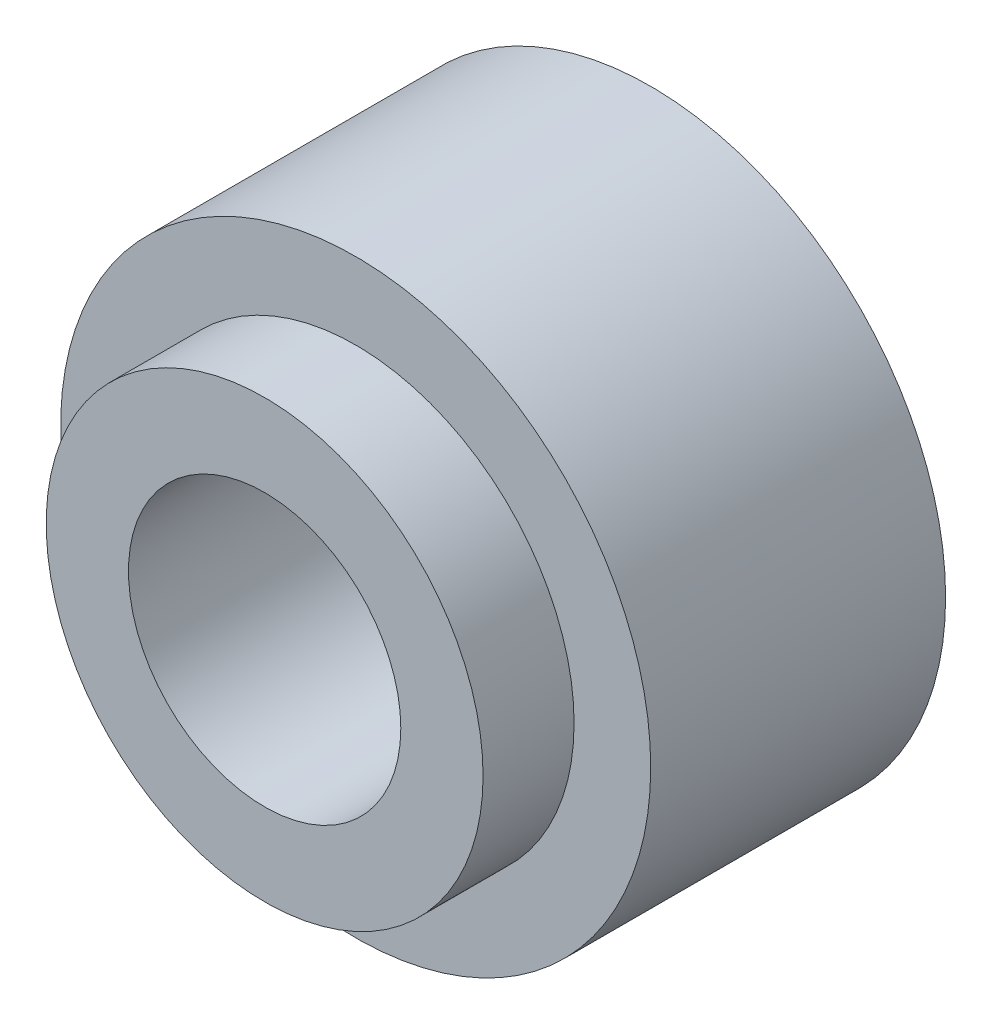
from build123d import *

# Parameters (mm, degrees)
SKETCH1_R          = 10.29335
EXTRUDE1_DEPTH     = 13.462
SKETCH2_R          = 10.29335
SKETCH2_R_2        = 7.62
CUT_EXTRUDE1_DEPTH = 3.175
SKETCH3_R          = 4.7498
CUT_EXTRUDE2_DEPTH = 20.827545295


with BuildPart() as part:
    # Sketch1 → Extrude1 (new body)
    with BuildSketch(Plane.XY):
        Circle(SKETCH1_R)
    extrude(amount=-EXTRUDE1_DEPTH)

    # Sketch2 → Cut-Extrude1 (cut)
    with BuildSketch(Plane.XY):
        Circle(SKETCH2_R)
        Circle(SKETCH2_R_2, mode=Mode.SUBTRACT)
    extrude(amount=-CUT_EXTRUDE1_DEPTH, mode=Mode.SUBTRACT)

    # Sketch3 → Cut-Extrude2 (cut, through all)
    with BuildSketch(Plane.XY):
        Circle(SKETCH3_R)
    extrude(amount=-CUT_EXTRUDE2_DEPTH, mode=Mode.SUBTRACT)


solid = part.part
